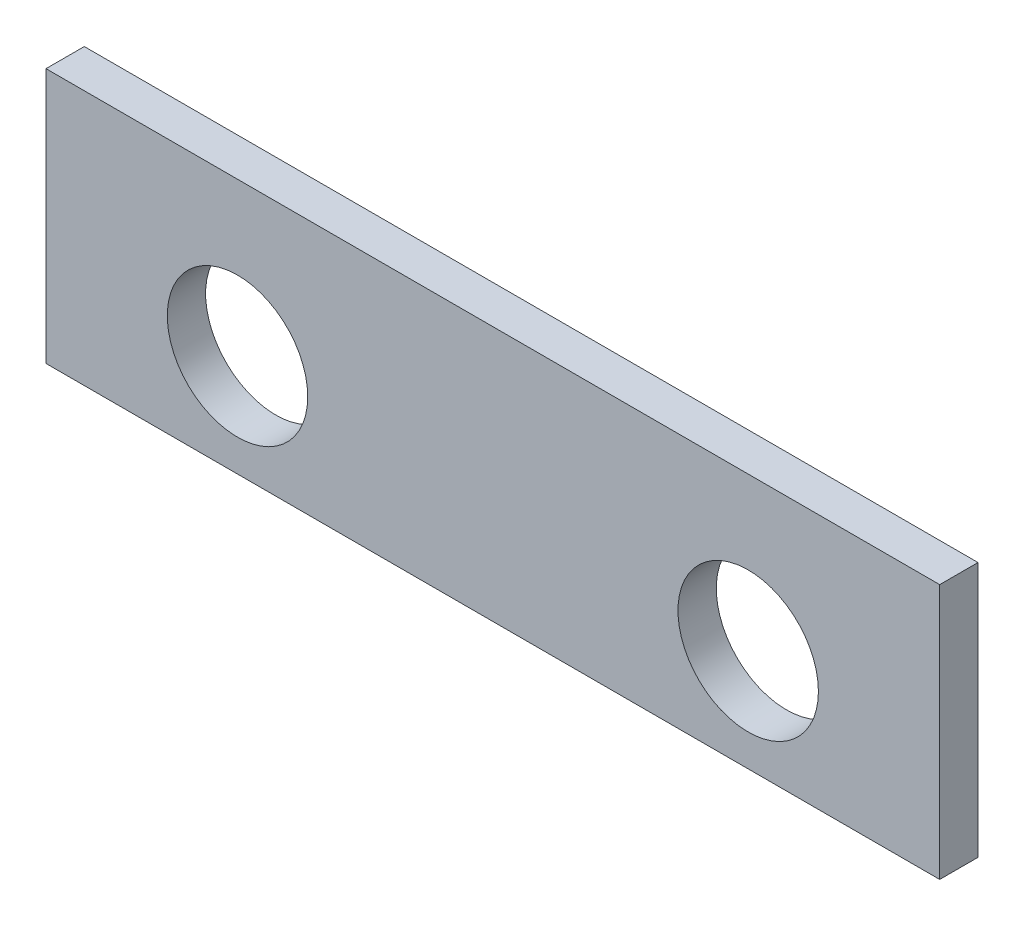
from build123d import *

# Parameters (mm, degrees)
ESQUISSE1_W      = 70
ESQUISSE1_H      = 20
ESQUISSE1_R      = 5.5
EXTRUSION1_DEPTH = 3


with BuildPart() as part:
    # Esquisse1 → Extrusion1 (new body)
    with BuildSketch(Plane.XY):
        with Locations((35, 10)):
            Rectangle(ESQUISSE1_W, ESQUISSE1_H)
        with Locations((15, 8)):
            Circle(ESQUISSE1_R, mode=Mode.SUBTRACT)
        with Locations((55, 8)):
            Circle(ESQUISSE1_R, mode=Mode.SUBTRACT)
    extrude(amount=EXTRUSION1_DEPTH)


solid = part.part
